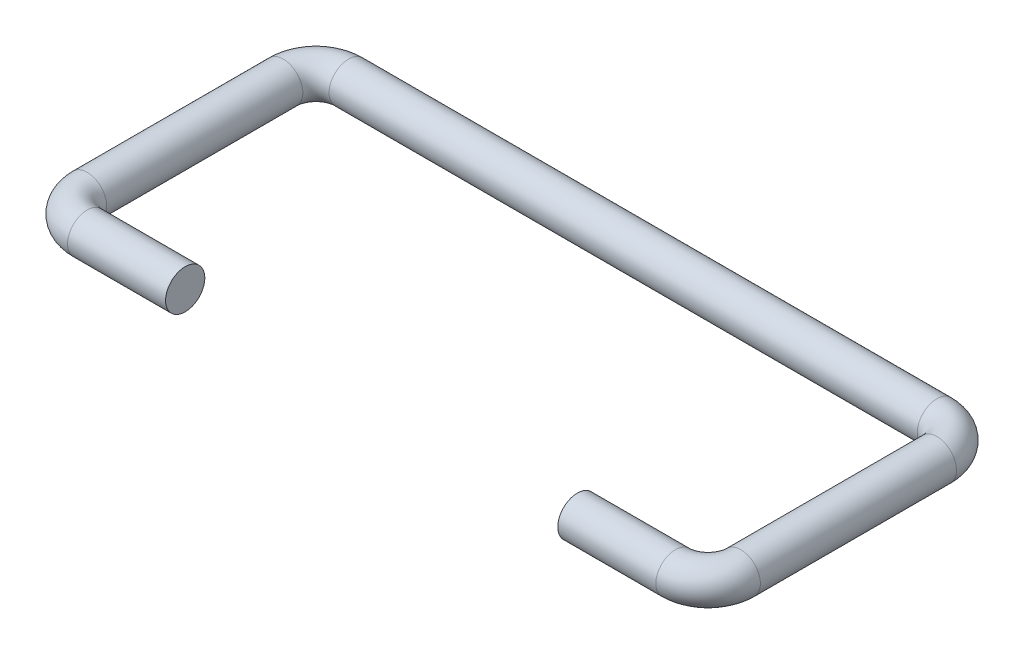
from build123d import *

# Parameters (mm, degrees)
SKETCH2_R          = 3
SKETCH3_W          = 60
SKETCH3_H          = 10
CUT_EXTRUDE1_DEPTH = 5


with BuildPart() as part:
    # Sweep1: sweep along a path in Sketch1
    with BuildLine(Plane(origin=(0, 0, 0), x_dir=(1, 0, 0), z_dir=(0, 1, 0))) as sweep1_path:
        Line((-45, 0), (45, 0))
        ThreePointArc((45, 0), (48.535533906, 1.464466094), (50, 5))
        Line((50, 5), (50, 35))
        ThreePointArc((50, 35), (48.535533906, 38.535533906), (45, 40))
        Line((45, 40), (-45, 40))
        ThreePointArc((-45, 40), (-48.535533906, 38.535533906), (-50, 35))
        Line((-50, 35), (-50, 5))
        ThreePointArc((-50, 5), (-48.535533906, 1.464466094), (-45, 0))
    # Sketch2 → Sweep1 (sweep)
    with BuildSketch(Plane(origin=(0, 0, 0), x_dir=(0, 0, -1), z_dir=(1, 0, 0))):
        Circle(SKETCH2_R)
    sweep(path=sweep1_path.line)

    # Sketch3 → Cut-Extrude1 (cut, symmetric)
    with BuildSketch(Plane(origin=(0, 0, 0), x_dir=(1, 0, 0), z_dir=(0, 1, 0))):
        Rectangle(SKETCH3_W, SKETCH3_H)
    extrude(amount=CUT_EXTRUDE1_DEPTH, both=True, mode=Mode.SUBTRACT)


solid = part.part
